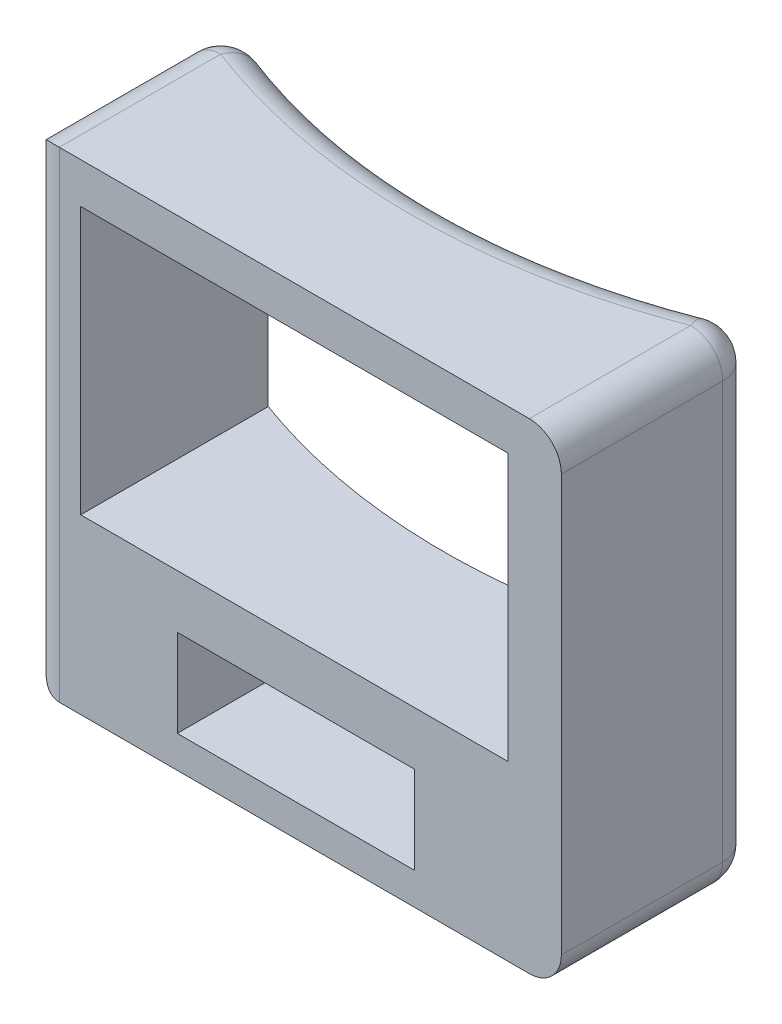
ISO-10303-21;
HEADER;
FILE_DESCRIPTION(('STEP AP214'),'2;1');
FILE_NAME('part.step','',(''),(''),'','','');
FILE_SCHEMA(('AUTOMOTIVE_DESIGN { 1 0 10303 214 1 1 1 1 }'));
ENDSEC;
DATA;
#1=APPLICATION_CONTEXT('core data for automotive mechanical design processes');
#2=APPLICATION_PROTOCOL_DEFINITION('international standard','automotive_design',2000,#1);
#3=PRODUCT_CONTEXT('',#1,'mechanical');
#4=PRODUCT('Part','Part','',(#3));
#5=PRODUCT_RELATED_PRODUCT_CATEGORY('part','',(#4));
#6=PRODUCT_DEFINITION_FORMATION('','',#4);
#7=PRODUCT_DEFINITION_CONTEXT('part definition',#1,'design');
#8=PRODUCT_DEFINITION('design','',#6,#7);
#9=PRODUCT_DEFINITION_SHAPE('','',#8);
#10=(LENGTH_UNIT() NAMED_UNIT(*) SI_UNIT(.MILLI.,.METRE.));
#11=(NAMED_UNIT(*) PLANE_ANGLE_UNIT() SI_UNIT($,.RADIAN.));
#12=(NAMED_UNIT(*) SI_UNIT($,.STERADIAN.) SOLID_ANGLE_UNIT());
#13=UNCERTAINTY_MEASURE_WITH_UNIT(LENGTH_MEASURE(1.E-05),#10,'distance_accuracy_value','');
#14=(GEOMETRIC_REPRESENTATION_CONTEXT(3) GLOBAL_UNCERTAINTY_ASSIGNED_CONTEXT((#13)) GLOBAL_UNIT_ASSIGNED_CONTEXT((#10,
#11,#12)) REPRESENTATION_CONTEXT('',''));
#15=CARTESIAN_POINT('',(0.,0.,0.));
#16=DIRECTION('',(0.,0.,1.));
#17=DIRECTION('',(1.,0.,0.));
#18=AXIS2_PLACEMENT_3D('',#15,#16,#17);
#19=CARTESIAN_POINT('',(25.,45.,52.3354564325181));
#20=DIRECTION('',(-1.,0.,0.));
#21=DIRECTION('',(0.,0.,1.));
#22=AXIS2_PLACEMENT_3D('',#19,#20,#21);
#23=PLANE('',#22);
#24=DIRECTION('',(0.,-1.,0.));
#25=VECTOR('',#24,1.);
#26=CARTESIAN_POINT('',(25.,45.,56.8946394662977));
#27=LINE('',#26,#25);
#28=CARTESIAN_POINT('',(25.,3.,56.8946394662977));
#29=VERTEX_POINT('',#28);
#30=CARTESIAN_POINT('',(25.,42.,56.8946394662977));
#31=VERTEX_POINT('',#30);
#32=EDGE_CURVE('E42',#29,#31,#27,.F.);
#33=ORIENTED_EDGE('',*,*,#32,.T.);
#34=DIRECTION('',(0.,0.,-1.));
#35=VECTOR('',#34,1.);
#36=CARTESIAN_POINT('',(25.,42.,72.));
#37=LINE('',#36,#35);
#38=CARTESIAN_POINT('',(25.,42.,72.));
#39=VERTEX_POINT('',#38);
#40=EDGE_CURVE('E11',#31,#39,#37,.F.);
#41=ORIENTED_EDGE('',*,*,#40,.T.);
#42=DIRECTION('',(0.,1.,0.));
#43=VECTOR('',#42,1.);
#44=CARTESIAN_POINT('',(25.,0.,72.));
#45=LINE('',#44,#43);
#46=CARTESIAN_POINT('',(25.,3.,72.));
#47=VERTEX_POINT('',#46);
#48=EDGE_CURVE('E308',#47,#39,#45,.T.);
#49=ORIENTED_EDGE('',*,*,#48,.F.);
#50=DIRECTION('',(0.,0.,-1.));
#51=VECTOR('',#50,1.);
#52=CARTESIAN_POINT('',(25.,3.,52.3354564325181));
#53=LINE('',#52,#51);
#54=EDGE_CURVE('E53',#47,#29,#53,.T.);
#55=ORIENTED_EDGE('',*,*,#54,.T.);
#56=EDGE_LOOP('',(#33,#41,#49,#55));
#57=FACE_BOUND('',#56,.T.);
#58=ADVANCED_FACE('F33',(#57),#23,.F.);
#59=CARTESIAN_POINT('',(-25.,45.,52.3354564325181));
#60=DIRECTION('',(1.,0.,0.));
#61=DIRECTION('',(0.,0.,-1.));
#62=AXIS2_PLACEMENT_3D('',#59,#60,#61);
#63=PLANE('',#62);
#64=DIRECTION('',(0.,-1.,0.));
#65=VECTOR('',#64,1.);
#66=CARTESIAN_POINT('',(-25.,45.,56.8946394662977));
#67=LINE('',#66,#65);
#68=CARTESIAN_POINT('',(-25.,42.,56.8946394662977));
#69=VERTEX_POINT('',#68);
#70=CARTESIAN_POINT('',(-25.,3.,56.8946394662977));
#71=VERTEX_POINT('',#70);
#72=EDGE_CURVE('E228',#69,#71,#67,.T.);
#73=ORIENTED_EDGE('',*,*,#72,.T.);
#74=DIRECTION('',(0.,0.,1.));
#75=VECTOR('',#74,1.);
#76=CARTESIAN_POINT('',(-25.,3.,52.3354564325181));
#77=LINE('',#76,#75);
#78=CARTESIAN_POINT('',(-25.,3.,69.));
#79=VERTEX_POINT('',#78);
#80=EDGE_CURVE('E230',#71,#79,#77,.T.);
#81=ORIENTED_EDGE('',*,*,#80,.T.);
#82=DIRECTION('',(0.,-1.,0.));
#83=VECTOR('',#82,1.);
#84=CARTESIAN_POINT('',(-25.,45.,69.));
#85=LINE('',#84,#83);
#86=CARTESIAN_POINT('',(-25.,42.,69.));
#87=VERTEX_POINT('',#86);
#88=EDGE_CURVE('E167',#79,#87,#85,.F.);
#89=ORIENTED_EDGE('',*,*,#88,.T.);
#90=DIRECTION('',(0.,0.,1.));
#91=VECTOR('',#90,1.);
#92=CARTESIAN_POINT('',(-25.,42.,52.3354564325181));
#93=LINE('',#92,#91);
#94=EDGE_CURVE('E226',#87,#69,#93,.F.);
#95=ORIENTED_EDGE('',*,*,#94,.T.);
#96=EDGE_LOOP('',(#73,#81,#89,#95));
#97=FACE_BOUND('',#96,.T.);
#98=ADVANCED_FACE('F377',(#97),#63,.F.);
#99=CARTESIAN_POINT('',(0.,45.,0.));
#100=DIRECTION('',(0.,1.,0.));
#101=DIRECTION('',(0.,0.,1.));
#102=AXIS2_PLACEMENT_3D('',#99,#100,#101);
#103=PLANE('',#102);
#104=CARTESIAN_POINT('',(0.,45.,0.));
#105=DIRECTION('',(0.,1.,0.));
#106=DIRECTION('',(0.,0.,1.));
#107=AXIS2_PLACEMENT_3D('',#104,#105,#106);
#108=CIRCLE('',#107,61.);
#109=CARTESIAN_POINT('',(22.,45.,56.8946394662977));
#110=VERTEX_POINT('',#109);
#111=CARTESIAN_POINT('',(-22.,45.,56.8946394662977));
#112=VERTEX_POINT('',#111);
#113=EDGE_CURVE('E253',#110,#112,#108,.F.);
#114=ORIENTED_EDGE('',*,*,#113,.T.);
#115=DIRECTION('',(0.,0.,1.));
#116=VECTOR('',#115,1.);
#117=CARTESIAN_POINT('',(-22.,45.,72.));
#118=LINE('',#117,#116);
#119=CARTESIAN_POINT('',(-22.,45.,72.));
#120=VERTEX_POINT('',#119);
#121=EDGE_CURVE('E255',#112,#120,#118,.T.);
#122=ORIENTED_EDGE('',*,*,#121,.T.);
#123=DIRECTION('',(-1.,0.,0.));
#124=VECTOR('',#123,1.);
#125=CARTESIAN_POINT('',(25.,45.,72.));
#126=LINE('',#125,#124);
#127=CARTESIAN_POINT('',(22.,45.,72.));
#128=VERTEX_POINT('',#127);
#129=EDGE_CURVE('E313',#128,#120,#126,.T.);
#130=ORIENTED_EDGE('',*,*,#129,.F.);
#131=DIRECTION('',(0.,0.,-1.));
#132=VECTOR('',#131,1.);
#133=CARTESIAN_POINT('',(22.,45.,52.3354564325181));
#134=LINE('',#133,#132);
#135=EDGE_CURVE('E251',#128,#110,#134,.T.);
#136=ORIENTED_EDGE('',*,*,#135,.T.);
#137=EDGE_LOOP('',(#114,#122,#130,#136));
#138=FACE_BOUND('',#137,.T.);
#139=ADVANCED_FACE('F382',(#138),#103,.T.);
#140=CARTESIAN_POINT('',(0.,0.,0.));
#141=DIRECTION('',(0.,1.,0.));
#142=DIRECTION('',(0.,0.,1.));
#143=AXIS2_PLACEMENT_3D('',#140,#141,#142);
#144=PLANE('',#143);
#145=DIRECTION('',(1.,0.,0.));
#146=VECTOR('',#145,1.);
#147=CARTESIAN_POINT('',(-25.,0.,72.));
#148=LINE('',#147,#146);
#149=CARTESIAN_POINT('',(-22.,0.,72.));
#150=VERTEX_POINT('',#149);
#151=CARTESIAN_POINT('',(22.,0.,72.));
#152=VERTEX_POINT('',#151);
#153=EDGE_CURVE('E303',#150,#152,#148,.T.);
#154=ORIENTED_EDGE('',*,*,#153,.F.);
#155=DIRECTION('',(0.,0.,1.));
#156=VECTOR('',#155,1.);
#157=CARTESIAN_POINT('',(-22.,0.,0.));
#158=LINE('',#157,#156);
#159=CARTESIAN_POINT('',(-22.,0.,56.8946394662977));
#160=VERTEX_POINT('',#159);
#161=EDGE_CURVE('E237',#150,#160,#158,.F.);
#162=ORIENTED_EDGE('',*,*,#161,.T.);
#163=CARTESIAN_POINT('',(0.,0.,0.));
#164=DIRECTION('',(0.,1.,0.));
#165=DIRECTION('',(0.,0.,1.));
#166=AXIS2_PLACEMENT_3D('',#163,#164,#165);
#167=CIRCLE('',#166,61.);
#168=CARTESIAN_POINT('',(22.,0.,56.8946394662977));
#169=VERTEX_POINT('',#168);
#170=EDGE_CURVE('E235',#160,#169,#167,.T.);
#171=ORIENTED_EDGE('',*,*,#170,.T.);
#172=DIRECTION('',(0.,0.,-1.));
#173=VECTOR('',#172,1.);
#174=CARTESIAN_POINT('',(22.,0.,0.));
#175=LINE('',#174,#173);
#176=EDGE_CURVE('E233',#169,#152,#175,.F.);
#177=ORIENTED_EDGE('',*,*,#176,.T.);
#178=EDGE_LOOP('',(#154,#162,#171,#177));
#179=FACE_BOUND('',#178,.T.);
#180=ADVANCED_FACE('F436',(#179),#144,.F.);
#181=CARTESIAN_POINT('',(11.2437788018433,11.2,52.3354564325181));
#182=DIRECTION('',(1.,0.,0.));
#183=DIRECTION('',(0.,1.,0.));
#184=AXIS2_PLACEMENT_3D('',#181,#182,#183);
#185=PLANE('',#184);
#186=DIRECTION('',(0.,-1.,0.));
#187=VECTOR('',#186,1.);
#188=CARTESIAN_POINT('',(11.2437788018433,11.2,72.));
#189=LINE('',#188,#187);
#190=CARTESIAN_POINT('',(11.2437788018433,11.2,72.));
#191=VERTEX_POINT('',#190);
#192=CARTESIAN_POINT('',(11.2437788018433,3.,72.));
#193=VERTEX_POINT('',#192);
#194=EDGE_CURVE('E185',#191,#193,#189,.T.);
#195=ORIENTED_EDGE('',*,*,#194,.F.);
#196=DIRECTION('',(0.,0.,1.));
#197=VECTOR('',#196,1.);
#198=CARTESIAN_POINT('',(11.2437788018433,11.2,52.3354564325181));
#199=LINE('',#198,#197);
#200=CARTESIAN_POINT('',(11.2437788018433,11.2,56.8997138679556));
#201=VERTEX_POINT('',#200);
#202=EDGE_CURVE('E202',#201,#191,#199,.T.);
#203=ORIENTED_EDGE('',*,*,#202,.F.);
#204=DIRECTION('',(0.,-1.,0.));
#205=VECTOR('',#204,1.);
#206=CARTESIAN_POINT('',(11.2437788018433,45.,56.8997138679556));
#207=LINE('',#206,#205);
#208=CARTESIAN_POINT('',(11.2437788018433,3.,56.8997138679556));
#209=VERTEX_POINT('',#208);
#210=EDGE_CURVE('E168',#209,#201,#207,.F.);
#211=ORIENTED_EDGE('',*,*,#210,.F.);
#212=DIRECTION('',(0.,0.,1.));
#213=VECTOR('',#212,1.);
#214=CARTESIAN_POINT('',(11.2437788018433,3.,52.3354564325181));
#215=LINE('',#214,#213);
#216=EDGE_CURVE('E203',#209,#193,#215,.T.);
#217=ORIENTED_EDGE('',*,*,#216,.T.);
#218=EDGE_LOOP('',(#195,#203,#211,#217));
#219=FACE_BOUND('',#218,.T.);
#220=ADVANCED_FACE('F366',(#219),#185,.F.);
#221=CARTESIAN_POINT('',(-10.9562211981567,3.,52.3354564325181));
#222=DIRECTION('',(0.,-1.,0.));
#223=DIRECTION('',(1.,0.,0.));
#224=AXIS2_PLACEMENT_3D('',#221,#222,#223);
#225=PLANE('',#224);
#226=DIRECTION('',(-1.,0.,0.));
#227=VECTOR('',#226,1.);
#228=CARTESIAN_POINT('',(-10.9562211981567,3.,72.));
#229=LINE('',#228,#227);
#230=CARTESIAN_POINT('',(-10.9562211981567,3.,72.));
#231=VERTEX_POINT('',#230);
#232=EDGE_CURVE('E189',#193,#231,#229,.T.);
#233=ORIENTED_EDGE('',*,*,#232,.F.);
#234=ORIENTED_EDGE('',*,*,#216,.F.);
#235=CARTESIAN_POINT('',(0.,3.,0.));
#236=DIRECTION('',(0.,-1.,0.));
#237=DIRECTION('',(1.,0.,0.));
#238=AXIS2_PLACEMENT_3D('',#235,#236,#237);
#239=CIRCLE('',#238,58.);
#240=CARTESIAN_POINT('',(-10.9562211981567,3.,56.9557829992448));
#241=VERTEX_POINT('',#240);
#242=EDGE_CURVE('E220',#241,#209,#239,.F.);
#243=ORIENTED_EDGE('',*,*,#242,.F.);
#244=DIRECTION('',(0.,0.,1.));
#245=VECTOR('',#244,1.);
#246=CARTESIAN_POINT('',(-10.9562211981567,3.,52.3354564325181));
#247=LINE('',#246,#245);
#248=EDGE_CURVE('E207',#241,#231,#247,.T.);
#249=ORIENTED_EDGE('',*,*,#248,.T.);
#250=EDGE_LOOP('',(#233,#234,#243,#249));
#251=FACE_BOUND('',#250,.T.);
#252=ADVANCED_FACE('F354',(#251),#225,.F.);
#253=CARTESIAN_POINT('',(-10.9562211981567,11.2,52.3354564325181));
#254=DIRECTION('',(-1.,0.,0.));
#255=DIRECTION('',(0.,-1.,0.));
#256=AXIS2_PLACEMENT_3D('',#253,#254,#255);
#257=PLANE('',#256);
#258=DIRECTION('',(0.,1.,0.));
#259=VECTOR('',#258,1.);
#260=CARTESIAN_POINT('',(-10.9562211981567,11.2,72.));
#261=LINE('',#260,#259);
#262=CARTESIAN_POINT('',(-10.9562211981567,11.2,72.));
#263=VERTEX_POINT('',#262);
#264=EDGE_CURVE('E321',#231,#263,#261,.T.);
#265=ORIENTED_EDGE('',*,*,#264,.F.);
#266=ORIENTED_EDGE('',*,*,#248,.F.);
#267=DIRECTION('',(0.,-1.,0.));
#268=VECTOR('',#267,1.);
#269=CARTESIAN_POINT('',(-10.9562211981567,45.,56.9557829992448));
#270=LINE('',#269,#268);
#271=CARTESIAN_POINT('',(-10.9562211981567,11.2,56.9557829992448));
#272=VERTEX_POINT('',#271);
#273=EDGE_CURVE('E217',#272,#241,#270,.T.);
#274=ORIENTED_EDGE('',*,*,#273,.F.);
#275=DIRECTION('',(0.,0.,1.));
#276=VECTOR('',#275,1.);
#277=CARTESIAN_POINT('',(-10.9562211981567,11.2,52.3354564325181));
#278=LINE('',#277,#276);
#279=EDGE_CURVE('E210',#272,#263,#278,.T.);
#280=ORIENTED_EDGE('',*,*,#279,.T.);
#281=EDGE_LOOP('',(#265,#266,#274,#280));
#282=FACE_BOUND('',#281,.T.);
#283=ADVANCED_FACE('F358',(#282),#257,.F.);
#284=CARTESIAN_POINT('',(-10.9562211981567,11.2,52.3354564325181));
#285=DIRECTION('',(0.,1.,0.));
#286=DIRECTION('',(0.,0.,1.));
#287=AXIS2_PLACEMENT_3D('',#284,#285,#286);
#288=PLANE('',#287);
#289=DIRECTION('',(1.,0.,0.));
#290=VECTOR('',#289,1.);
#291=CARTESIAN_POINT('',(-10.9562211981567,11.2,72.));
#292=LINE('',#291,#290);
#293=EDGE_CURVE('E178',#263,#191,#292,.T.);
#294=ORIENTED_EDGE('',*,*,#293,.F.);
#295=ORIENTED_EDGE('',*,*,#279,.F.);
#296=CARTESIAN_POINT('',(0.,11.2,0.));
#297=DIRECTION('',(0.,1.,0.));
#298=DIRECTION('',(0.,0.,1.));
#299=AXIS2_PLACEMENT_3D('',#296,#297,#298);
#300=CIRCLE('',#299,58.);
#301=EDGE_CURVE('E206',#201,#272,#300,.F.);
#302=ORIENTED_EDGE('',*,*,#301,.F.);
#303=ORIENTED_EDGE('',*,*,#202,.T.);
#304=EDGE_LOOP('',(#294,#295,#302,#303));
#305=FACE_BOUND('',#304,.T.);
#306=ADVANCED_FACE('F363',(#305),#288,.F.);
#307=CARTESIAN_POINT('',(20.,41.2,52.3354564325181));
#308=DIRECTION('',(1.,0.,0.));
#309=DIRECTION('',(0.,0.,-1.));
#310=AXIS2_PLACEMENT_3D('',#307,#308,#309);
#311=PLANE('',#310);
#312=DIRECTION('',(0.,-1.,0.));
#313=VECTOR('',#312,1.);
#314=CARTESIAN_POINT('',(20.,41.2,72.));
#315=LINE('',#314,#313);
#316=CARTESIAN_POINT('',(20.,41.2,72.));
#317=VERTEX_POINT('',#316);
#318=CARTESIAN_POINT('',(20.,16.2,72.));
#319=VERTEX_POINT('',#318);
#320=EDGE_CURVE('E160',#317,#319,#315,.T.);
#321=ORIENTED_EDGE('',*,*,#320,.F.);
#322=DIRECTION('',(0.,0.,1.));
#323=VECTOR('',#322,1.);
#324=CARTESIAN_POINT('',(20.,41.2,52.3354564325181));
#325=LINE('',#324,#323);
#326=CARTESIAN_POINT('',(20.,41.2,54.4426303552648));
#327=VERTEX_POINT('',#326);
#328=EDGE_CURVE('E174',#327,#317,#325,.T.);
#329=ORIENTED_EDGE('',*,*,#328,.F.);
#330=DIRECTION('',(0.,-1.,0.));
#331=VECTOR('',#330,1.);
#332=CARTESIAN_POINT('',(20.,45.,54.4426303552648));
#333=LINE('',#332,#331);
#334=CARTESIAN_POINT('',(20.,16.2,54.4426303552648));
#335=VERTEX_POINT('',#334);
#336=EDGE_CURVE('E200',#335,#327,#333,.F.);
#337=ORIENTED_EDGE('',*,*,#336,.F.);
#338=DIRECTION('',(0.,0.,1.));
#339=VECTOR('',#338,1.);
#340=CARTESIAN_POINT('',(20.,16.2,52.3354564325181));
#341=LINE('',#340,#339);
#342=EDGE_CURVE('E177',#335,#319,#341,.T.);
#343=ORIENTED_EDGE('',*,*,#342,.T.);
#344=EDGE_LOOP('',(#321,#329,#337,#343));
#345=FACE_BOUND('',#344,.T.);
#346=ADVANCED_FACE('F173',(#345),#311,.F.);
#347=CARTESIAN_POINT('',(-20.,16.2,52.3354564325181));
#348=DIRECTION('',(0.,-1.,0.));
#349=DIRECTION('',(0.,0.,-1.));
#350=AXIS2_PLACEMENT_3D('',#347,#348,#349);
#351=PLANE('',#350);
#352=DIRECTION('',(-1.,0.,0.));
#353=VECTOR('',#352,1.);
#354=CARTESIAN_POINT('',(-20.,16.2,72.));
#355=LINE('',#354,#353);
#356=CARTESIAN_POINT('',(-20.,16.2,72.));
#357=VERTEX_POINT('',#356);
#358=EDGE_CURVE('E179',#319,#357,#355,.T.);
#359=ORIENTED_EDGE('',*,*,#358,.F.);
#360=ORIENTED_EDGE('',*,*,#342,.F.);
#361=CARTESIAN_POINT('',(0.,16.2,0.));
#362=DIRECTION('',(0.,-1.,0.));
#363=DIRECTION('',(0.,0.,-1.));
#364=AXIS2_PLACEMENT_3D('',#361,#362,#363);
#365=CIRCLE('',#364,58.);
#366=CARTESIAN_POINT('',(-20.,16.2,54.4426303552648));
#367=VERTEX_POINT('',#366);
#368=EDGE_CURVE('E197',#367,#335,#365,.F.);
#369=ORIENTED_EDGE('',*,*,#368,.F.);
#370=DIRECTION('',(0.,0.,1.));
#371=VECTOR('',#370,1.);
#372=CARTESIAN_POINT('',(-20.,16.2,52.3354564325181));
#373=LINE('',#372,#371);
#374=EDGE_CURVE('E187',#367,#357,#373,.T.);
#375=ORIENTED_EDGE('',*,*,#374,.T.);
#376=EDGE_LOOP('',(#359,#360,#369,#375));
#377=FACE_BOUND('',#376,.T.);
#378=ADVANCED_FACE('F327',(#377),#351,.F.);
#379=CARTESIAN_POINT('',(-20.,41.2,52.3354564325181));
#380=DIRECTION('',(-1.,0.,0.));
#381=DIRECTION('',(0.,-1.,0.));
#382=AXIS2_PLACEMENT_3D('',#379,#380,#381);
#383=PLANE('',#382);
#384=DIRECTION('',(0.,1.,0.));
#385=VECTOR('',#384,1.);
#386=CARTESIAN_POINT('',(-20.,41.2,72.));
#387=LINE('',#386,#385);
#388=CARTESIAN_POINT('',(-20.,41.2,72.));
#389=VERTEX_POINT('',#388);
#390=EDGE_CURVE('E163',#357,#389,#387,.T.);
#391=ORIENTED_EDGE('',*,*,#390,.F.);
#392=ORIENTED_EDGE('',*,*,#374,.F.);
#393=DIRECTION('',(0.,-1.,0.));
#394=VECTOR('',#393,1.);
#395=CARTESIAN_POINT('',(-20.,45.,54.4426303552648));
#396=LINE('',#395,#394);
#397=CARTESIAN_POINT('',(-20.,41.2,54.4426303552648));
#398=VERTEX_POINT('',#397);
#399=EDGE_CURVE('E194',#398,#367,#396,.T.);
#400=ORIENTED_EDGE('',*,*,#399,.F.);
#401=DIRECTION('',(0.,0.,1.));
#402=VECTOR('',#401,1.);
#403=CARTESIAN_POINT('',(-20.,41.2,52.3354564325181));
#404=LINE('',#403,#402);
#405=EDGE_CURVE('E184',#398,#389,#404,.T.);
#406=ORIENTED_EDGE('',*,*,#405,.T.);
#407=EDGE_LOOP('',(#391,#392,#400,#406));
#408=FACE_BOUND('',#407,.T.);
#409=ADVANCED_FACE('F330',(#408),#383,.F.);
#410=CARTESIAN_POINT('',(-20.,41.2,52.3354564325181));
#411=DIRECTION('',(0.,1.,0.));
#412=DIRECTION('',(-1.,0.,0.));
#413=AXIS2_PLACEMENT_3D('',#410,#411,#412);
#414=PLANE('',#413);
#415=DIRECTION('',(1.,0.,0.));
#416=VECTOR('',#415,1.);
#417=CARTESIAN_POINT('',(-20.,41.2,72.));
#418=LINE('',#417,#416);
#419=EDGE_CURVE('E156',#389,#317,#418,.T.);
#420=ORIENTED_EDGE('',*,*,#419,.F.);
#421=ORIENTED_EDGE('',*,*,#405,.F.);
#422=CARTESIAN_POINT('',(0.,41.2,0.));
#423=DIRECTION('',(0.,1.,0.));
#424=DIRECTION('',(-1.,0.,0.));
#425=AXIS2_PLACEMENT_3D('',#422,#423,#424);
#426=CIRCLE('',#425,58.);
#427=EDGE_CURVE('E183',#327,#398,#426,.F.);
#428=ORIENTED_EDGE('',*,*,#427,.F.);
#429=ORIENTED_EDGE('',*,*,#328,.T.);
#430=EDGE_LOOP('',(#420,#421,#428,#429));
#431=FACE_BOUND('',#430,.T.);
#432=ADVANCED_FACE('F181',(#431),#414,.F.);
#433=CARTESIAN_POINT('',(0.,45.,0.));
#434=DIRECTION('',(0.,-1.,0.));
#435=DIRECTION('',(0.,0.,-1.));
#436=AXIS2_PLACEMENT_3D('',#433,#434,#435);
#437=CYLINDRICAL_SURFACE('',#436,58.);
#438=ORIENTED_EDGE('',*,*,#368,.T.);
#439=ORIENTED_EDGE('',*,*,#336,.T.);
#440=ORIENTED_EDGE('',*,*,#427,.T.);
#441=ORIENTED_EDGE('',*,*,#399,.T.);
#442=EDGE_LOOP('',(#438,#439,#440,#441));
#443=FACE_BOUND('',#442,.T.);
#444=DIRECTION('',(0.,-1.,0.));
#445=VECTOR('',#444,1.);
#446=CARTESIAN_POINT('',(20.9180327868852,45.,54.096542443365));
#447=LINE('',#446,#445);
#448=CARTESIAN_POINT('',(20.9180327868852,42.,54.096542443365));
#449=VERTEX_POINT('',#448);
#450=CARTESIAN_POINT('',(20.9180327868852,3.,54.096542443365));
#451=VERTEX_POINT('',#450);
#452=EDGE_CURVE('E242',#449,#451,#447,.T.);
#453=ORIENTED_EDGE('',*,*,#452,.T.);
#454=CARTESIAN_POINT('',(0.,3.,0.));
#455=DIRECTION('',(0.,1.,0.));
#456=DIRECTION('',(0.,0.,1.));
#457=AXIS2_PLACEMENT_3D('',#454,#455,#456);
#458=CIRCLE('',#457,58.);
#459=EDGE_CURVE('E249',#451,#209,#458,.F.);
#460=ORIENTED_EDGE('',*,*,#459,.T.);
#461=ORIENTED_EDGE('',*,*,#210,.T.);
#462=ORIENTED_EDGE('',*,*,#301,.T.);
#463=ORIENTED_EDGE('',*,*,#273,.T.);
#464=CARTESIAN_POINT('',(0.,3.,0.));
#465=DIRECTION('',(0.,1.,0.));
#466=DIRECTION('',(0.,0.,1.));
#467=AXIS2_PLACEMENT_3D('',#464,#465,#466);
#468=CIRCLE('',#467,58.);
#469=CARTESIAN_POINT('',(-20.9180327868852,3.,54.096542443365));
#470=VERTEX_POINT('',#469);
#471=EDGE_CURVE('E247',#241,#470,#468,.F.);
#472=ORIENTED_EDGE('',*,*,#471,.T.);
#473=DIRECTION('',(0.,-1.,0.));
#474=VECTOR('',#473,1.);
#475=CARTESIAN_POINT('',(-20.9180327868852,45.,54.096542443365));
#476=LINE('',#475,#474);
#477=CARTESIAN_POINT('',(-20.9180327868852,42.,54.096542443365));
#478=VERTEX_POINT('',#477);
#479=EDGE_CURVE('E244',#470,#478,#476,.F.);
#480=ORIENTED_EDGE('',*,*,#479,.T.);
#481=CARTESIAN_POINT('',(0.,42.,0.));
#482=DIRECTION('',(0.,1.,0.));
#483=DIRECTION('',(0.,0.,1.));
#484=AXIS2_PLACEMENT_3D('',#481,#482,#483);
#485=CIRCLE('',#484,58.);
#486=EDGE_CURVE('E240',#478,#449,#485,.T.);
#487=ORIENTED_EDGE('',*,*,#486,.T.);
#488=EDGE_LOOP('',(#453,#460,#461,#462,#463,#472,#480,#487));
#489=FACE_BOUND('',#488,.T.);
#490=ADVANCED_FACE('F332',(#443,#489),#437,.F.);
#491=CARTESIAN_POINT('',(0.,0.,72.));
#492=DIRECTION('',(0.,0.,1.));
#493=DIRECTION('',(1.,0.,0.));
#494=AXIS2_PLACEMENT_3D('',#491,#492,#493);
#495=PLANE('',#494);
#496=ORIENTED_EDGE('',*,*,#320,.T.);
#497=ORIENTED_EDGE('',*,*,#358,.T.);
#498=ORIENTED_EDGE('',*,*,#390,.T.);
#499=ORIENTED_EDGE('',*,*,#419,.T.);
#500=EDGE_LOOP('',(#496,#497,#498,#499));
#501=FACE_BOUND('',#500,.T.);
#502=ORIENTED_EDGE('',*,*,#129,.T.);
#503=DIRECTION('',(0.,-1.,0.));
#504=VECTOR('',#503,1.);
#505=CARTESIAN_POINT('',(-22.,0.,72.));
#506=LINE('',#505,#504);
#507=EDGE_CURVE('E261',#120,#150,#506,.T.);
#508=ORIENTED_EDGE('',*,*,#507,.T.);
#509=ORIENTED_EDGE('',*,*,#153,.T.);
#510=CARTESIAN_POINT('',(22.,3.,72.));
#511=DIRECTION('',(0.,0.,1.));
#512=DIRECTION('',(1.,0.,0.));
#513=AXIS2_PLACEMENT_3D('',#510,#511,#512);
#514=CIRCLE('',#513,3.);
#515=EDGE_CURVE('E257',#152,#47,#514,.T.);
#516=ORIENTED_EDGE('',*,*,#515,.T.);
#517=ORIENTED_EDGE('',*,*,#48,.T.);
#518=CARTESIAN_POINT('',(22.,42.,72.));
#519=DIRECTION('',(0.,0.,1.));
#520=DIRECTION('',(1.,0.,0.));
#521=AXIS2_PLACEMENT_3D('',#518,#519,#520);
#522=CIRCLE('',#521,3.);
#523=EDGE_CURVE('E259',#39,#128,#522,.T.);
#524=ORIENTED_EDGE('',*,*,#523,.T.);
#525=EDGE_LOOP('',(#502,#508,#509,#516,#517,#524));
#526=FACE_BOUND('',#525,.T.);
#527=ORIENTED_EDGE('',*,*,#194,.T.);
#528=ORIENTED_EDGE('',*,*,#232,.T.);
#529=ORIENTED_EDGE('',*,*,#264,.T.);
#530=ORIENTED_EDGE('',*,*,#293,.T.);
#531=EDGE_LOOP('',(#527,#528,#529,#530));
#532=FACE_BOUND('',#531,.T.);
#533=ADVANCED_FACE('F158',(#501,#526,#532),#495,.T.);
#534=CARTESIAN_POINT('',(22.,42.,0.));
#535=DIRECTION('',(0.,0.,1.));
#536=DIRECTION('',(1.,0.,0.));
#537=AXIS2_PLACEMENT_3D('',#534,#535,#536);
#538=CYLINDRICAL_SURFACE('',#537,3.);
#539=CARTESIAN_POINT('',(22.,42.,56.8946394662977));
#540=DIRECTION('',(0.,0.,-1.));
#541=DIRECTION('',(-1.,0.,0.));
#542=AXIS2_PLACEMENT_3D('',#539,#540,#541);
#543=CIRCLE('',#542,3.);
#544=EDGE_CURVE('E37',#110,#31,#543,.T.);
#545=ORIENTED_EDGE('',*,*,#544,.F.);
#546=ORIENTED_EDGE('',*,*,#135,.F.);
#547=ORIENTED_EDGE('',*,*,#523,.F.);
#548=ORIENTED_EDGE('',*,*,#40,.F.);
#549=EDGE_LOOP('',(#545,#546,#547,#548));
#550=FACE_BOUND('',#549,.T.);
#551=ADVANCED_FACE('F35',(#550),#538,.T.);
#552=CARTESIAN_POINT('',(22.,42.,56.8946394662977));
#553=DIRECTION('',(0.,1.,0.));
#554=DIRECTION('',(0.,0.,1.));
#555=AXIS2_PLACEMENT_3D('',#552,#553,#554);
#556=SPHERICAL_SURFACE('',#555,3.);
#557=CARTESIAN_POINT('',(22.,42.,56.8946394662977));
#558=DIRECTION('',(0.932699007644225,0.,-0.360655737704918));
#559=DIRECTION('',(-0.360655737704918,0.,-0.932699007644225));
#560=AXIS2_PLACEMENT_3D('',#557,#558,#559);
#561=CIRCLE('',#560,3.);
#562=EDGE_CURVE('E295',#110,#449,#561,.F.);
#563=ORIENTED_EDGE('',*,*,#562,.F.);
#564=ORIENTED_EDGE('',*,*,#544,.T.);
#565=CARTESIAN_POINT('',(22.,42.,56.8946394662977));
#566=DIRECTION('',(0.,1.,0.));
#567=DIRECTION('',(0.,0.,1.));
#568=AXIS2_PLACEMENT_3D('',#565,#566,#567);
#569=CIRCLE('',#568,3.);
#570=EDGE_CURVE('E297',#449,#31,#569,.F.);
#571=ORIENTED_EDGE('',*,*,#570,.F.);
#572=EDGE_LOOP('',(#563,#564,#571));
#573=FACE_BOUND('',#572,.T.);
#574=ADVANCED_FACE('F373',(#573),#556,.T.);
#575=CARTESIAN_POINT('',(22.,3.,52.3354564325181));
#576=DIRECTION('',(0.,0.,-1.));
#577=DIRECTION('',(-1.,0.,0.));
#578=AXIS2_PLACEMENT_3D('',#575,#576,#577);
#579=CYLINDRICAL_SURFACE('',#578,3.);
#580=ORIENTED_EDGE('',*,*,#515,.F.);
#581=ORIENTED_EDGE('',*,*,#176,.F.);
#582=CARTESIAN_POINT('',(22.,3.,56.8946394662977));
#583=DIRECTION('',(0.,0.,-1.));
#584=DIRECTION('',(0.,1.,0.));
#585=AXIS2_PLACEMENT_3D('',#582,#583,#584);
#586=CIRCLE('',#585,3.);
#587=EDGE_CURVE('E292',#29,#169,#586,.T.);
#588=ORIENTED_EDGE('',*,*,#587,.F.);
#589=ORIENTED_EDGE('',*,*,#54,.F.);
#590=EDGE_LOOP('',(#580,#581,#588,#589));
#591=FACE_BOUND('',#590,.T.);
#592=ADVANCED_FACE('F420',(#591),#579,.T.);
#593=CARTESIAN_POINT('',(22.,45.,56.8946394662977));
#594=DIRECTION('',(0.,-1.,0.));
#595=DIRECTION('',(0.,0.,-1.));
#596=AXIS2_PLACEMENT_3D('',#593,#594,#595);
#597=CYLINDRICAL_SURFACE('',#596,3.);
#598=ORIENTED_EDGE('',*,*,#570,.T.);
#599=ORIENTED_EDGE('',*,*,#32,.F.);
#600=CARTESIAN_POINT('',(22.,3.,56.8946394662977));
#601=DIRECTION('',(0.,-1.,0.));
#602=DIRECTION('',(0.,0.,-1.));
#603=AXIS2_PLACEMENT_3D('',#600,#601,#602);
#604=CIRCLE('',#603,3.);
#605=EDGE_CURVE('E289',#451,#29,#604,.T.);
#606=ORIENTED_EDGE('',*,*,#605,.F.);
#607=ORIENTED_EDGE('',*,*,#452,.F.);
#608=EDGE_LOOP('',(#598,#599,#606,#607));
#609=FACE_BOUND('',#608,.T.);
#610=ADVANCED_FACE('F341',(#609),#597,.T.);
#611=CARTESIAN_POINT('',(0.,42.,0.));
#612=DIRECTION('',(0.,1.,0.));
#613=DIRECTION('',(0.,0.,1.));
#614=AXIS2_PLACEMENT_3D('',#611,#612,#613);
#615=TOROIDAL_SURFACE('',#614,61.,3.);
#616=ORIENTED_EDGE('',*,*,#562,.T.);
#617=ORIENTED_EDGE('',*,*,#486,.F.);
#618=CARTESIAN_POINT('',(-22.,42.,56.8946394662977));
#619=DIRECTION('',(-0.932699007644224,0.,-0.360655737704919));
#620=DIRECTION('',(-0.360655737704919,0.,0.932699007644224));
#621=AXIS2_PLACEMENT_3D('',#618,#619,#620);
#622=CIRCLE('',#621,3.);
#623=EDGE_CURVE('E286',#112,#478,#622,.T.);
#624=ORIENTED_EDGE('',*,*,#623,.F.);
#625=ORIENTED_EDGE('',*,*,#113,.F.);
#626=EDGE_LOOP('',(#616,#617,#624,#625));
#627=FACE_BOUND('',#626,.T.);
#628=ADVANCED_FACE('F414',(#627),#615,.T.);
#629=CARTESIAN_POINT('',(22.,3.,56.8946394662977));
#630=DIRECTION('',(0.,-1.,0.));
#631=DIRECTION('',(1.,0.,0.));
#632=AXIS2_PLACEMENT_3D('',#629,#630,#631);
#633=SPHERICAL_SURFACE('',#632,3.);
#634=ORIENTED_EDGE('',*,*,#605,.T.);
#635=ORIENTED_EDGE('',*,*,#587,.T.);
#636=CARTESIAN_POINT('',(22.,3.,56.8946394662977));
#637=DIRECTION('',(0.932699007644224,0.,-0.36065573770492));
#638=DIRECTION('',(-0.36065573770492,0.,-0.932699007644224));
#639=AXIS2_PLACEMENT_3D('',#636,#637,#638);
#640=CIRCLE('',#639,3.);
#641=EDGE_CURVE('E283',#451,#169,#640,.F.);
#642=ORIENTED_EDGE('',*,*,#641,.F.);
#643=EDGE_LOOP('',(#634,#635,#642));
#644=FACE_BOUND('',#643,.T.);
#645=ADVANCED_FACE('F344',(#644),#633,.T.);
#646=CARTESIAN_POINT('',(-22.,42.,56.8946394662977));
#647=DIRECTION('',(0.,1.,0.));
#648=DIRECTION('',(0.,0.,1.));
#649=AXIS2_PLACEMENT_3D('',#646,#647,#648);
#650=SPHERICAL_SURFACE('',#649,3.);
#651=CARTESIAN_POINT('',(-22.,42.,56.8946394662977));
#652=DIRECTION('',(0.,0.,-1.));
#653=DIRECTION('',(0.,1.,0.));
#654=AXIS2_PLACEMENT_3D('',#651,#652,#653);
#655=CIRCLE('',#654,3.);
#656=EDGE_CURVE('E278',#112,#69,#655,.F.);
#657=ORIENTED_EDGE('',*,*,#656,.F.);
#658=ORIENTED_EDGE('',*,*,#623,.T.);
#659=CARTESIAN_POINT('',(-22.,42.,56.8946394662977));
#660=DIRECTION('',(0.,1.,0.));
#661=DIRECTION('',(0.,0.,1.));
#662=AXIS2_PLACEMENT_3D('',#659,#660,#661);
#663=CIRCLE('',#662,3.);
#664=EDGE_CURVE('E281',#69,#478,#663,.F.);
#665=ORIENTED_EDGE('',*,*,#664,.F.);
#666=EDGE_LOOP('',(#657,#658,#665));
#667=FACE_BOUND('',#666,.T.);
#668=ADVANCED_FACE('F408',(#667),#650,.T.);
#669=CARTESIAN_POINT('',(0.,3.,0.));
#670=DIRECTION('',(0.,1.,0.));
#671=DIRECTION('',(0.,0.,1.));
#672=AXIS2_PLACEMENT_3D('',#669,#670,#671);
#673=TOROIDAL_SURFACE('',#672,61.,3.);
#674=ORIENTED_EDGE('',*,*,#641,.T.);
#675=ORIENTED_EDGE('',*,*,#170,.F.);
#676=CARTESIAN_POINT('',(-22.,3.,56.8946394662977));
#677=DIRECTION('',(-0.932699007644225,0.,-0.360655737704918));
#678=DIRECTION('',(-0.360655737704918,0.,0.932699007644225));
#679=AXIS2_PLACEMENT_3D('',#676,#677,#678);
#680=CIRCLE('',#679,3.);
#681=EDGE_CURVE('E275',#470,#160,#680,.T.);
#682=ORIENTED_EDGE('',*,*,#681,.F.);
#683=ORIENTED_EDGE('',*,*,#471,.F.);
#684=ORIENTED_EDGE('',*,*,#242,.T.);
#685=ORIENTED_EDGE('',*,*,#459,.F.);
#686=EDGE_LOOP('',(#674,#675,#682,#683,#684,#685));
#687=FACE_BOUND('',#686,.T.);
#688=ADVANCED_FACE('F347',(#687),#673,.T.);
#689=CARTESIAN_POINT('',(-22.,45.,56.8946394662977));
#690=DIRECTION('',(0.,-1.,0.));
#691=DIRECTION('',(0.,0.,-1.));
#692=AXIS2_PLACEMENT_3D('',#689,#690,#691);
#693=CYLINDRICAL_SURFACE('',#692,3.);
#694=ORIENTED_EDGE('',*,*,#664,.T.);
#695=ORIENTED_EDGE('',*,*,#479,.F.);
#696=CARTESIAN_POINT('',(-22.,3.,56.8946394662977));
#697=DIRECTION('',(0.,-1.,0.));
#698=DIRECTION('',(0.,0.,-1.));
#699=AXIS2_PLACEMENT_3D('',#696,#697,#698);
#700=CIRCLE('',#699,3.);
#701=EDGE_CURVE('E272',#71,#470,#700,.T.);
#702=ORIENTED_EDGE('',*,*,#701,.F.);
#703=ORIENTED_EDGE('',*,*,#72,.F.);
#704=EDGE_LOOP('',(#694,#695,#702,#703));
#705=FACE_BOUND('',#704,.T.);
#706=ADVANCED_FACE('F401',(#705),#693,.T.);
#707=CARTESIAN_POINT('',(-22.,42.,0.));
#708=DIRECTION('',(0.,0.,-1.));
#709=DIRECTION('',(-1.,0.,0.));
#710=AXIS2_PLACEMENT_3D('',#707,#708,#709);
#711=CYLINDRICAL_SURFACE('',#710,3.);
#712=ORIENTED_EDGE('',*,*,#656,.T.);
#713=ORIENTED_EDGE('',*,*,#94,.F.);
#714=CARTESIAN_POINT('',(-22.,42.,69.));
#715=DIRECTION('',(0.,0.707106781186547,-0.707106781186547));
#716=DIRECTION('',(0.,0.707106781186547,0.707106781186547));
#717=AXIS2_PLACEMENT_3D('',#714,#715,#716);
#718=ELLIPSE('',#717,4.24264068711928,3.);
#719=EDGE_CURVE('E269',#120,#87,#718,.F.);
#720=ORIENTED_EDGE('',*,*,#719,.F.);
#721=ORIENTED_EDGE('',*,*,#121,.F.);
#722=EDGE_LOOP('',(#712,#713,#720,#721));
#723=FACE_BOUND('',#722,.T.);
#724=ADVANCED_FACE('F397',(#723),#711,.T.);
#725=CARTESIAN_POINT('',(-22.,3.,56.8946394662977));
#726=DIRECTION('',(0.,-1.,0.));
#727=DIRECTION('',(0.,0.,-1.));
#728=AXIS2_PLACEMENT_3D('',#725,#726,#727);
#729=SPHERICAL_SURFACE('',#728,3.);
#730=ORIENTED_EDGE('',*,*,#701,.T.);
#731=ORIENTED_EDGE('',*,*,#681,.T.);
#732=CARTESIAN_POINT('',(-22.,3.,56.8946394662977));
#733=DIRECTION('',(0.,0.,-1.));
#734=DIRECTION('',(-1.,0.,0.));
#735=AXIS2_PLACEMENT_3D('',#732,#733,#734);
#736=CIRCLE('',#735,3.);
#737=EDGE_CURVE('E267',#71,#160,#736,.F.);
#738=ORIENTED_EDGE('',*,*,#737,.F.);
#739=EDGE_LOOP('',(#730,#731,#738));
#740=FACE_BOUND('',#739,.T.);
#741=ADVANCED_FACE('F393',(#740),#729,.T.);
#742=CARTESIAN_POINT('',(-22.,0.,69.));
#743=DIRECTION('',(0.,1.,0.));
#744=DIRECTION('',(0.,0.,1.));
#745=AXIS2_PLACEMENT_3D('',#742,#743,#744);
#746=CYLINDRICAL_SURFACE('',#745,3.);
#747=ORIENTED_EDGE('',*,*,#719,.T.);
#748=ORIENTED_EDGE('',*,*,#88,.F.);
#749=CARTESIAN_POINT('',(-22.,3.,69.));
#750=DIRECTION('',(0.,0.707106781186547,0.707106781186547));
#751=DIRECTION('',(0.,0.707106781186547,-0.707106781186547));
#752=AXIS2_PLACEMENT_3D('',#749,#750,#751);
#753=ELLIPSE('',#752,4.24264068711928,3.);
#754=EDGE_CURVE('E265',#150,#79,#753,.F.);
#755=ORIENTED_EDGE('',*,*,#754,.F.);
#756=ORIENTED_EDGE('',*,*,#507,.F.);
#757=EDGE_LOOP('',(#747,#748,#755,#756));
#758=FACE_BOUND('',#757,.T.);
#759=ADVANCED_FACE('F389',(#758),#746,.T.);
#760=CARTESIAN_POINT('',(-22.,3.,52.3354564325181));
#761=DIRECTION('',(0.,0.,1.));
#762=DIRECTION('',(1.,0.,0.));
#763=AXIS2_PLACEMENT_3D('',#760,#761,#762);
#764=CYLINDRICAL_SURFACE('',#763,3.);
#765=ORIENTED_EDGE('',*,*,#737,.T.);
#766=ORIENTED_EDGE('',*,*,#161,.F.);
#767=ORIENTED_EDGE('',*,*,#754,.T.);
#768=ORIENTED_EDGE('',*,*,#80,.F.);
#769=EDGE_LOOP('',(#765,#766,#767,#768));
#770=FACE_BOUND('',#769,.T.);
#771=ADVANCED_FACE('F386',(#770),#764,.T.);
#772=CLOSED_SHELL('',(#58,#98,#139,#180,#220,#252,#283,#306,#346,#378,#409,#432,#490,#533,#551,
#574,#592,#610,#628,#645,#668,#688,#706,#724,#741,#759,#771));
#773=MANIFOLD_SOLID_BREP('B2',#772);
#774=ADVANCED_BREP_SHAPE_REPRESENTATION('',(#18,#773),#14);
#775=SHAPE_DEFINITION_REPRESENTATION(#9,#774);
ENDSEC;
END-ISO-10303-21;
